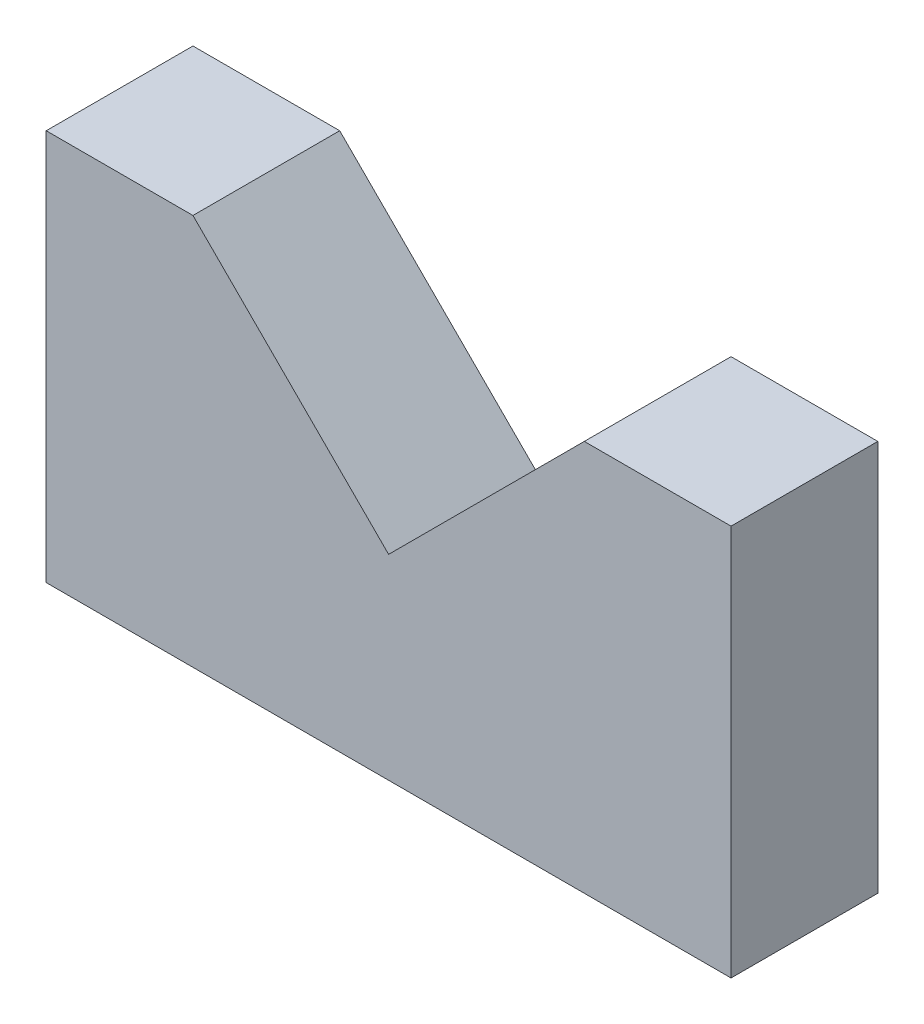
from build123d import *

# Parameters (mm, degrees)
EXTRUSION1_DEPTH = 15


with BuildPart() as part:
    # Esquisse1 → Extrusion1 (new body)
    with BuildSketch(Plane.XY):
        Polygon((0, 0), (0, 40), (15, 40), (34.999997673, 20), (55, 40), (70, 40), (70, 0), align=None)
    extrude(amount=EXTRUSION1_DEPTH)


solid = part.part
